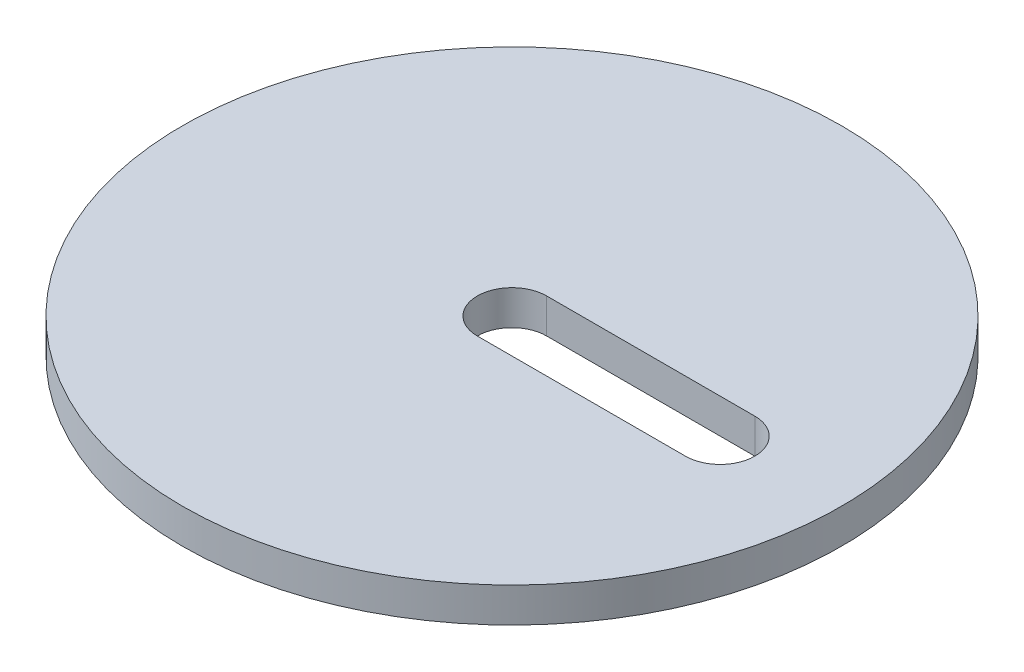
ISO-10303-21;
HEADER;
FILE_DESCRIPTION(('STEP AP214'),'2;1');
FILE_NAME('part.step','',(''),(''),'','','');
FILE_SCHEMA(('AUTOMOTIVE_DESIGN { 1 0 10303 214 1 1 1 1 }'));
ENDSEC;
DATA;
#1=APPLICATION_CONTEXT('core data for automotive mechanical design processes');
#2=APPLICATION_PROTOCOL_DEFINITION('international standard','automotive_design',2000,#1);
#3=PRODUCT_CONTEXT('',#1,'mechanical');
#4=PRODUCT('Part','Part','',(#3));
#5=PRODUCT_RELATED_PRODUCT_CATEGORY('part','',(#4));
#6=PRODUCT_DEFINITION_FORMATION('','',#4);
#7=PRODUCT_DEFINITION_CONTEXT('part definition',#1,'design');
#8=PRODUCT_DEFINITION('design','',#6,#7);
#9=PRODUCT_DEFINITION_SHAPE('','',#8);
#10=(LENGTH_UNIT() NAMED_UNIT(*) SI_UNIT(.MILLI.,.METRE.));
#11=(NAMED_UNIT(*) PLANE_ANGLE_UNIT() SI_UNIT($,.RADIAN.));
#12=(NAMED_UNIT(*) SI_UNIT($,.STERADIAN.) SOLID_ANGLE_UNIT());
#13=UNCERTAINTY_MEASURE_WITH_UNIT(LENGTH_MEASURE(1.E-05),#10,'distance_accuracy_value','');
#14=(GEOMETRIC_REPRESENTATION_CONTEXT(3) GLOBAL_UNCERTAINTY_ASSIGNED_CONTEXT((#13)) GLOBAL_UNIT_ASSIGNED_CONTEXT((#10,
#11,#12)) REPRESENTATION_CONTEXT('',''));
#15=CARTESIAN_POINT('',(0.,0.,0.));
#16=DIRECTION('',(0.,0.,1.));
#17=DIRECTION('',(1.,0.,0.));
#18=AXIS2_PLACEMENT_3D('',#15,#16,#17);
#19=CARTESIAN_POINT('',(0.,3.175,0.));
#20=DIRECTION('',(0.,1.,0.));
#21=DIRECTION('',(0.,0.,1.));
#22=AXIS2_PLACEMENT_3D('',#19,#20,#21);
#23=PLANE('',#22);
#24=CARTESIAN_POINT('',(0.,3.175,0.));
#25=DIRECTION('',(0.,1.,0.));
#26=DIRECTION('',(0.,0.,1.));
#27=AXIS2_PLACEMENT_3D('',#24,#25,#26);
#28=CIRCLE('',#27,30.1625);
#29=CARTESIAN_POINT('',(0.,3.175,30.1625));
#30=VERTEX_POINT('',#29);
#31=EDGE_CURVE('E11',#30,#30,#28,.T.);
#32=ORIENTED_EDGE('',*,*,#31,.T.);
#33=EDGE_LOOP('',(#32));
#34=FACE_BOUND('',#33,.T.);
#35=DIRECTION('',(1.,0.,0.));
#36=VECTOR('',#35,1.);
#37=CARTESIAN_POINT('',(0.,3.175,3.175));
#38=LINE('',#37,#36);
#39=CARTESIAN_POINT('',(0.,3.175,3.175));
#40=VERTEX_POINT('',#39);
#41=CARTESIAN_POINT('',(19.05,3.175,3.175));
#42=VERTEX_POINT('',#41);
#43=EDGE_CURVE('E81',#40,#42,#38,.T.);
#44=ORIENTED_EDGE('',*,*,#43,.F.);
#45=CARTESIAN_POINT('',(0.,3.175,0.));
#46=DIRECTION('',(0.,1.,0.));
#47=DIRECTION('',(0.,0.,1.));
#48=AXIS2_PLACEMENT_3D('',#45,#46,#47);
#49=CIRCLE('',#48,3.175);
#50=CARTESIAN_POINT('',(0.,3.175,-3.175));
#51=VERTEX_POINT('',#50);
#52=EDGE_CURVE('E73',#51,#40,#49,.T.);
#53=ORIENTED_EDGE('',*,*,#52,.F.);
#54=DIRECTION('',(-1.,0.,0.));
#55=VECTOR('',#54,1.);
#56=CARTESIAN_POINT('',(0.,3.175,-3.175));
#57=LINE('',#56,#55);
#58=CARTESIAN_POINT('',(19.05,3.175,-3.175));
#59=VERTEX_POINT('',#58);
#60=EDGE_CURVE('E94',#59,#51,#57,.T.);
#61=ORIENTED_EDGE('',*,*,#60,.F.);
#62=CARTESIAN_POINT('',(19.05,3.175,0.));
#63=DIRECTION('',(0.,1.,0.));
#64=DIRECTION('',(0.,0.,1.));
#65=AXIS2_PLACEMENT_3D('',#62,#63,#64);
#66=CIRCLE('',#65,3.175);
#67=EDGE_CURVE('E92',#42,#59,#66,.T.);
#68=ORIENTED_EDGE('',*,*,#67,.F.);
#69=EDGE_LOOP('',(#44,#53,#61,#68));
#70=FACE_BOUND('',#69,.T.);
#71=ADVANCED_FACE('F32',(#34,#70),#23,.T.);
#72=CARTESIAN_POINT('',(0.,0.,0.));
#73=DIRECTION('',(0.,1.,0.));
#74=DIRECTION('',(0.,0.,1.));
#75=AXIS2_PLACEMENT_3D('',#72,#73,#74);
#76=PLANE('',#75);
#77=CARTESIAN_POINT('',(0.,0.,0.));
#78=DIRECTION('',(0.,1.,0.));
#79=DIRECTION('',(0.,0.,1.));
#80=AXIS2_PLACEMENT_3D('',#77,#78,#79);
#81=CIRCLE('',#80,30.1625);
#82=CARTESIAN_POINT('',(0.,0.,30.1625));
#83=VERTEX_POINT('',#82);
#84=EDGE_CURVE('E36',#83,#83,#81,.T.);
#85=ORIENTED_EDGE('',*,*,#84,.F.);
#86=EDGE_LOOP('',(#85));
#87=FACE_BOUND('',#86,.T.);
#88=CARTESIAN_POINT('',(0.,0.,0.));
#89=DIRECTION('',(0.,1.,0.));
#90=DIRECTION('',(0.,0.,1.));
#91=AXIS2_PLACEMENT_3D('',#88,#89,#90);
#92=CIRCLE('',#91,3.175);
#93=CARTESIAN_POINT('',(0.,0.,-3.175));
#94=VERTEX_POINT('',#93);
#95=CARTESIAN_POINT('',(0.,0.,3.175));
#96=VERTEX_POINT('',#95);
#97=EDGE_CURVE('E55',#94,#96,#92,.T.);
#98=ORIENTED_EDGE('',*,*,#97,.T.);
#99=DIRECTION('',(1.,0.,0.));
#100=VECTOR('',#99,1.);
#101=CARTESIAN_POINT('',(0.,0.,3.175));
#102=LINE('',#101,#100);
#103=CARTESIAN_POINT('',(19.05,0.,3.175));
#104=VERTEX_POINT('',#103);
#105=EDGE_CURVE('E88',#96,#104,#102,.T.);
#106=ORIENTED_EDGE('',*,*,#105,.T.);
#107=CARTESIAN_POINT('',(19.05,0.,0.));
#108=DIRECTION('',(0.,1.,0.));
#109=DIRECTION('',(0.,0.,1.));
#110=AXIS2_PLACEMENT_3D('',#107,#108,#109);
#111=CIRCLE('',#110,3.175);
#112=CARTESIAN_POINT('',(19.05,0.,-3.175));
#113=VERTEX_POINT('',#112);
#114=EDGE_CURVE('E100',#104,#113,#111,.T.);
#115=ORIENTED_EDGE('',*,*,#114,.T.);
#116=DIRECTION('',(-1.,0.,0.));
#117=VECTOR('',#116,1.);
#118=CARTESIAN_POINT('',(0.,0.,-3.175));
#119=LINE('',#118,#117);
#120=EDGE_CURVE('E82',#113,#94,#119,.T.);
#121=ORIENTED_EDGE('',*,*,#120,.T.);
#122=EDGE_LOOP('',(#98,#106,#115,#121));
#123=FACE_BOUND('',#122,.T.);
#124=ADVANCED_FACE('F111',(#87,#123),#76,.F.);
#125=CARTESIAN_POINT('',(0.,3.175,0.));
#126=DIRECTION('',(0.,-1.,0.));
#127=DIRECTION('',(0.,0.,-1.));
#128=AXIS2_PLACEMENT_3D('',#125,#126,#127);
#129=CYLINDRICAL_SURFACE('',#128,30.1625);
#130=ORIENTED_EDGE('',*,*,#31,.F.);
#131=EDGE_LOOP('',(#130));
#132=FACE_BOUND('',#131,.T.);
#133=ORIENTED_EDGE('',*,*,#84,.T.);
#134=EDGE_LOOP('',(#133));
#135=FACE_BOUND('',#134,.T.);
#136=ADVANCED_FACE('F34',(#132,#135),#129,.T.);
#137=CARTESIAN_POINT('',(0.,3.175,0.));
#138=DIRECTION('',(0.,-1.,0.));
#139=DIRECTION('',(0.,0.,-1.));
#140=AXIS2_PLACEMENT_3D('',#137,#138,#139);
#141=CYLINDRICAL_SURFACE('',#140,3.175);
#142=ORIENTED_EDGE('',*,*,#97,.F.);
#143=DIRECTION('',(0.,-1.,0.));
#144=VECTOR('',#143,1.);
#145=CARTESIAN_POINT('',(0.,3.175,-3.175));
#146=LINE('',#145,#144);
#147=EDGE_CURVE('E77',#51,#94,#146,.T.);
#148=ORIENTED_EDGE('',*,*,#147,.F.);
#149=ORIENTED_EDGE('',*,*,#52,.T.);
#150=DIRECTION('',(0.,-1.,0.));
#151=VECTOR('',#150,1.);
#152=CARTESIAN_POINT('',(0.,3.175,3.175));
#153=LINE('',#152,#151);
#154=EDGE_CURVE('E76',#40,#96,#153,.T.);
#155=ORIENTED_EDGE('',*,*,#154,.T.);
#156=EDGE_LOOP('',(#142,#148,#149,#155));
#157=FACE_BOUND('',#156,.T.);
#158=ADVANCED_FACE('F75',(#157),#141,.F.);
#159=CARTESIAN_POINT('',(0.,3.175,3.175));
#160=DIRECTION('',(0.,0.,-1.));
#161=DIRECTION('',(-1.,0.,0.));
#162=AXIS2_PLACEMENT_3D('',#159,#160,#161);
#163=PLANE('',#162);
#164=ORIENTED_EDGE('',*,*,#105,.F.);
#165=ORIENTED_EDGE('',*,*,#154,.F.);
#166=ORIENTED_EDGE('',*,*,#43,.T.);
#167=DIRECTION('',(0.,-1.,0.));
#168=VECTOR('',#167,1.);
#169=CARTESIAN_POINT('',(19.05,3.175,3.175));
#170=LINE('',#169,#168);
#171=EDGE_CURVE('E89',#42,#104,#170,.T.);
#172=ORIENTED_EDGE('',*,*,#171,.T.);
#173=EDGE_LOOP('',(#164,#165,#166,#172));
#174=FACE_BOUND('',#173,.T.);
#175=ADVANCED_FACE('F85',(#174),#163,.T.);
#176=CARTESIAN_POINT('',(19.05,3.175,0.));
#177=DIRECTION('',(0.,-1.,0.));
#178=DIRECTION('',(0.,0.,-1.));
#179=AXIS2_PLACEMENT_3D('',#176,#177,#178);
#180=CYLINDRICAL_SURFACE('',#179,3.175);
#181=ORIENTED_EDGE('',*,*,#114,.F.);
#182=ORIENTED_EDGE('',*,*,#171,.F.);
#183=ORIENTED_EDGE('',*,*,#67,.T.);
#184=DIRECTION('',(0.,-1.,0.));
#185=VECTOR('',#184,1.);
#186=CARTESIAN_POINT('',(19.05,3.175,-3.175));
#187=LINE('',#186,#185);
#188=EDGE_CURVE('E47',#59,#113,#187,.T.);
#189=ORIENTED_EDGE('',*,*,#188,.T.);
#190=EDGE_LOOP('',(#181,#182,#183,#189));
#191=FACE_BOUND('',#190,.T.);
#192=ADVANCED_FACE('F109',(#191),#180,.F.);
#193=CARTESIAN_POINT('',(0.,3.175,-3.175));
#194=DIRECTION('',(0.,0.,1.));
#195=DIRECTION('',(1.,0.,0.));
#196=AXIS2_PLACEMENT_3D('',#193,#194,#195);
#197=PLANE('',#196);
#198=ORIENTED_EDGE('',*,*,#120,.F.);
#199=ORIENTED_EDGE('',*,*,#188,.F.);
#200=ORIENTED_EDGE('',*,*,#60,.T.);
#201=ORIENTED_EDGE('',*,*,#147,.T.);
#202=EDGE_LOOP('',(#198,#199,#200,#201));
#203=FACE_BOUND('',#202,.T.);
#204=ADVANCED_FACE('F112',(#203),#197,.T.);
#205=CLOSED_SHELL('',(#71,#124,#136,#158,#175,#192,#204));
#206=MANIFOLD_SOLID_BREP('B2',#205);
#207=ADVANCED_BREP_SHAPE_REPRESENTATION('',(#18,#206),#14);
#208=SHAPE_DEFINITION_REPRESENTATION(#9,#207);
ENDSEC;
END-ISO-10303-21;
